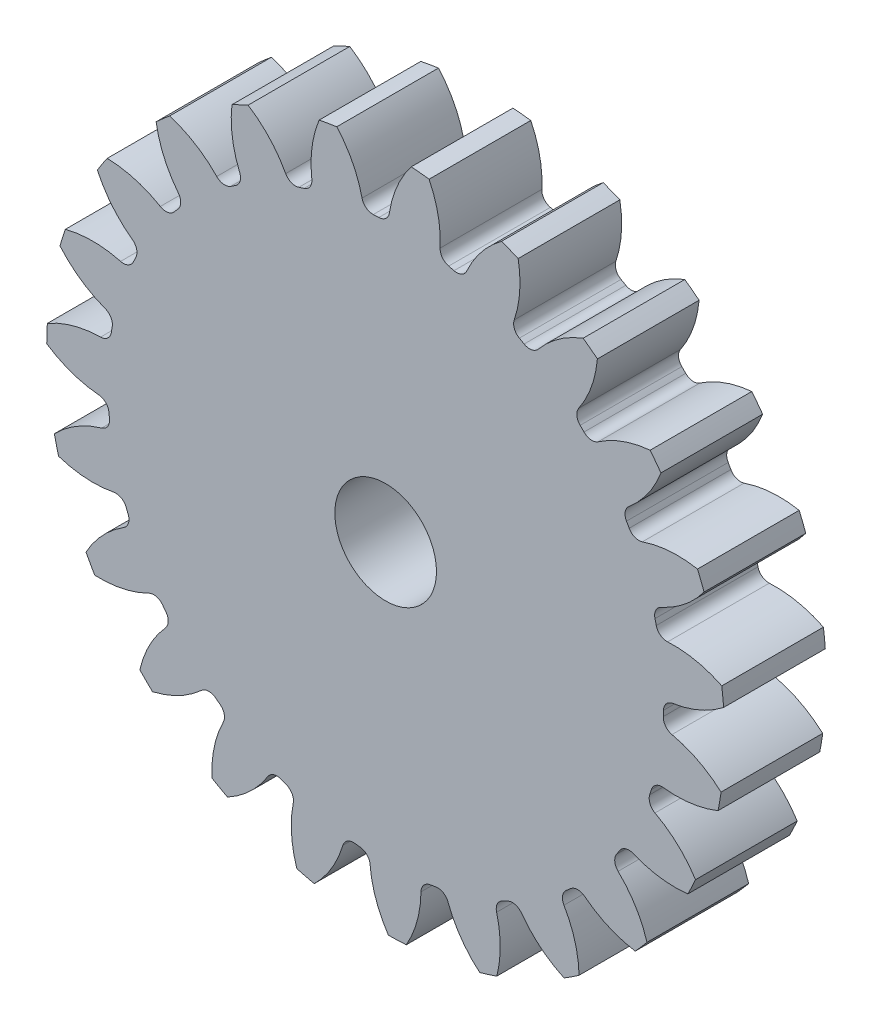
from build123d import *

# Parameters (mm, degrees)
SKETCH3_R         = 423.333333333
GEARBODY_DEPTH    = 127
TOOTHCUT_DEPTH    = 613.00590048
CIRPATTERN1_COUNT = 23
BOREDIA_R         = 63.5
BORE_DEPTH        = 12700


with BuildPart() as part:
    # Sketch3 → gearBody (new body)
    with BuildSketch(Plane.XY):
        Circle(SKETCH3_R)
    extrude(amount=GEARBODY_DEPTH)

    # Sketch2 → toothCut (cut, through all)
    with BuildSketch(Plane.XY):
        with BuildLine():
            ThreePointArc((346.802531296, -15.151085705), (346.9354951, -11.718077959), (347.0344763, -8.283922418))
            ThreePointArc((347.0344763, -8.283922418), (350.466072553, 0.492408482), (358.734308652, 5.013039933))
            ThreePointArc((358.734308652, 5.013039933), (392.889431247, 14.908671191), (423.333333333, 33.284327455))
            ThreePointArc((423.333333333, 33.284327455), (424.397786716, -14.334440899), (420.122685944, -61.772860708))
            ThreePointArc((420.122685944, -61.772860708), (390.988062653, -41.384882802), (357.578487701, -29.207189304))
            ThreePointArc((357.578487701, -29.207189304), (349.634124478, -24.138961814), (346.802531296, -15.151085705))
        make_face()
    toothcut = extrude(amount=TOOTHCUT_DEPTH, mode=Mode.SUBTRACT)

    # CirPattern1: toothCut ×23 about axis
    cirpattern1_axis = Axis((0, 0, 0), (0, 0, 1))
    for i in range(1, CIRPATTERN1_COUNT):
        add(toothcut.rotate(cirpattern1_axis, i * 360 / CIRPATTERN1_COUNT), mode=Mode.SUBTRACT)

    # boreDia → bore (cut, symmetric)
    with BuildSketch(Plane.XY):
        Circle(BOREDIA_R)
    extrude(amount=BORE_DEPTH, both=True, mode=Mode.SUBTRACT)


solid = part.part
